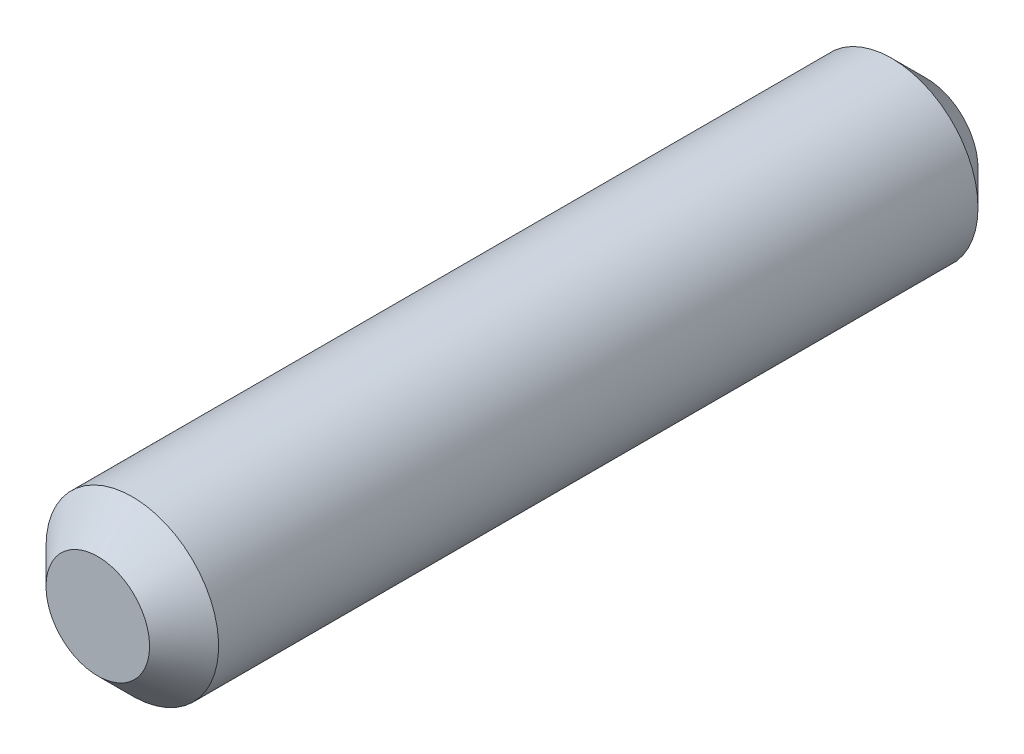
from build123d import *

# Parameters (mm, degrees)
ESQUISSE1_R          = 2.5
BASE_EXTRUSION_DEPTH = 24
CHANFREIN1_SIZE      = 1


with BuildPart() as part:
    # Esquisse1 → Base-Extrusion (new body)
    with BuildSketch(Plane.XY):
        with Locations(Location((0, 0, 0), (0, 0, 180))):
            Circle(ESQUISSE1_R)
    extrude(amount=BASE_EXTRUSION_DEPTH)

    # Chanfrein1
    chanfrein1_edges = [part.edges().sort_by_distance(p)[0] for p in [
        (2.5, 0, 0),
        (2.5, 0, 24),
    ]]
    chamfer(chanfrein1_edges, length=CHANFREIN1_SIZE)


solid = part.part
